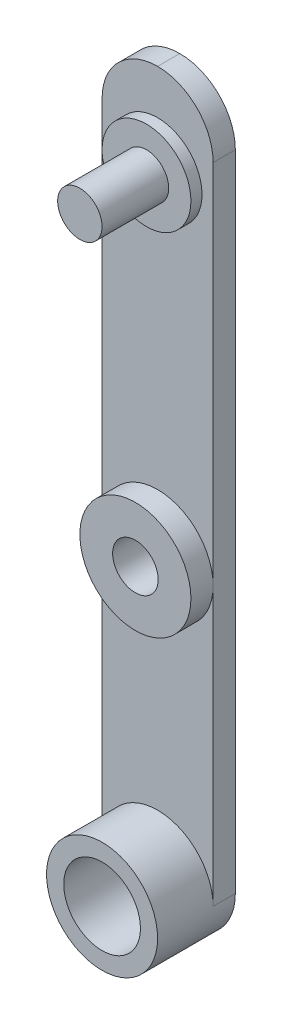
ISO-10303-21;
HEADER;
FILE_DESCRIPTION(('STEP AP214'),'2;1');
FILE_NAME('part.step','',(''),(''),'','','');
FILE_SCHEMA(('AUTOMOTIVE_DESIGN { 1 0 10303 214 1 1 1 1 }'));
ENDSEC;
DATA;
#1=APPLICATION_CONTEXT('core data for automotive mechanical design processes');
#2=APPLICATION_PROTOCOL_DEFINITION('international standard','automotive_design',2000,#1);
#3=PRODUCT_CONTEXT('',#1,'mechanical');
#4=PRODUCT('Part','Part','',(#3));
#5=PRODUCT_RELATED_PRODUCT_CATEGORY('part','',(#4));
#6=PRODUCT_DEFINITION_FORMATION('','',#4);
#7=PRODUCT_DEFINITION_CONTEXT('part definition',#1,'design');
#8=PRODUCT_DEFINITION('design','',#6,#7);
#9=PRODUCT_DEFINITION_SHAPE('','',#8);
#10=(LENGTH_UNIT() NAMED_UNIT(*) SI_UNIT(.MILLI.,.METRE.));
#11=(NAMED_UNIT(*) PLANE_ANGLE_UNIT() SI_UNIT($,.RADIAN.));
#12=(NAMED_UNIT(*) SI_UNIT($,.STERADIAN.) SOLID_ANGLE_UNIT());
#13=UNCERTAINTY_MEASURE_WITH_UNIT(LENGTH_MEASURE(1.E-05),#10,'distance_accuracy_value','');
#14=(GEOMETRIC_REPRESENTATION_CONTEXT(3) GLOBAL_UNCERTAINTY_ASSIGNED_CONTEXT((#13)) GLOBAL_UNIT_ASSIGNED_CONTEXT((#10,
#11,#12)) REPRESENTATION_CONTEXT('',''));
#15=CARTESIAN_POINT('',(0.,0.,0.));
#16=DIRECTION('',(0.,0.,1.));
#17=DIRECTION('',(1.,0.,0.));
#18=AXIS2_PLACEMENT_3D('',#15,#16,#17);
#19=CARTESIAN_POINT('',(0.,-25.,2.));
#20=DIRECTION('',(0.,0.,1.));
#21=DIRECTION('',(1.,0.,0.));
#22=AXIS2_PLACEMENT_3D('',#19,#20,#21);
#23=PLANE('',#22);
#24=DIRECTION('',(0.,-1.,0.));
#25=VECTOR('',#24,1.);
#26=CARTESIAN_POINT('',(-5.,38.,2.));
#27=LINE('',#26,#25);
#28=CARTESIAN_POINT('',(-5.,0.,2.));
#29=VERTEX_POINT('',#28);
#30=CARTESIAN_POINT('',(-4.99999999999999,-25.,2.));
#31=VERTEX_POINT('',#30);
#32=EDGE_CURVE('E119',#29,#31,#27,.T.);
#33=ORIENTED_EDGE('',*,*,#32,.T.);
#34=CARTESIAN_POINT('',(0.,-25.,2.));
#35=DIRECTION('',(0.,0.,1.));
#36=DIRECTION('',(1.,0.,0.));
#37=AXIS2_PLACEMENT_3D('',#34,#35,#36);
#38=CIRCLE('',#37,5.);
#39=CARTESIAN_POINT('',(5.00000000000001,-25.,2.));
#40=VERTEX_POINT('',#39);
#41=EDGE_CURVE('E113',#40,#31,#38,.T.);
#42=ORIENTED_EDGE('',*,*,#41,.F.);
#43=DIRECTION('',(0.,1.,0.));
#44=VECTOR('',#43,1.);
#45=CARTESIAN_POINT('',(5.,38.,2.));
#46=LINE('',#45,#44);
#47=CARTESIAN_POINT('',(5.00000000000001,0.,2.));
#48=VERTEX_POINT('',#47);
#49=EDGE_CURVE('E96',#40,#48,#46,.T.);
#50=ORIENTED_EDGE('',*,*,#49,.T.);
#51=CARTESIAN_POINT('',(0.,0.,2.));
#52=DIRECTION('',(0.,0.,1.));
#53=DIRECTION('',(1.,0.,0.));
#54=AXIS2_PLACEMENT_3D('',#51,#52,#53);
#55=CIRCLE('',#54,5.);
#56=EDGE_CURVE('E134',#29,#48,#55,.T.);
#57=ORIENTED_EDGE('',*,*,#56,.F.);
#58=EDGE_LOOP('',(#33,#42,#50,#57));
#59=FACE_BOUND('',#58,.T.);
#60=ADVANCED_FACE('F45',(#59),#23,.T.);
#61=CARTESIAN_POINT('',(0.,30.,2.));
#62=DIRECTION('',(0.,0.,1.));
#63=DIRECTION('',(1.,0.,0.));
#64=AXIS2_PLACEMENT_3D('',#61,#62,#63);
#65=CIRCLE('',#64,4.);
#66=CARTESIAN_POINT('',(4.,30.,2.));
#67=VERTEX_POINT('',#66);
#68=EDGE_CURVE('E144',#67,#67,#65,.T.);
#69=ORIENTED_EDGE('',*,*,#68,.F.);
#70=EDGE_LOOP('',(#69));
#71=FACE_BOUND('',#70,.T.);
#72=CARTESIAN_POINT('',(5.,33.,2.));
#73=VERTEX_POINT('',#72);
#74=EDGE_CURVE('E103',#48,#73,#46,.T.);
#75=ORIENTED_EDGE('',*,*,#74,.T.);
#76=CARTESIAN_POINT('',(0.,33.,2.));
#77=DIRECTION('',(0.,0.,1.));
#78=DIRECTION('',(1.,0.,0.));
#79=AXIS2_PLACEMENT_3D('',#76,#77,#78);
#80=CIRCLE('',#79,5.);
#81=CARTESIAN_POINT('',(0.,38.,2.));
#82=VERTEX_POINT('',#81);
#83=EDGE_CURVE('E54',#73,#82,#80,.T.);
#84=ORIENTED_EDGE('',*,*,#83,.T.);
#85=CARTESIAN_POINT('',(0.,33.,2.));
#86=DIRECTION('',(0.,0.,1.));
#87=DIRECTION('',(1.,0.,0.));
#88=AXIS2_PLACEMENT_3D('',#85,#86,#87);
#89=CIRCLE('',#88,5.);
#90=CARTESIAN_POINT('',(-5.,33.,2.));
#91=VERTEX_POINT('',#90);
#92=EDGE_CURVE('E64',#82,#91,#89,.T.);
#93=ORIENTED_EDGE('',*,*,#92,.T.);
#94=EDGE_CURVE('E155',#91,#29,#27,.T.);
#95=ORIENTED_EDGE('',*,*,#94,.T.);
#96=EDGE_CURVE('E139',#48,#29,#55,.T.);
#97=ORIENTED_EDGE('',*,*,#96,.F.);
#98=EDGE_LOOP('',(#75,#84,#93,#95,#97));
#99=FACE_BOUND('',#98,.T.);
#100=ADVANCED_FACE('F175',(#71,#99),#23,.T.);
#101=CARTESIAN_POINT('',(-5.,38.,2.));
#102=DIRECTION('',(1.,0.,0.));
#103=DIRECTION('',(0.,1.,0.));
#104=AXIS2_PLACEMENT_3D('',#101,#102,#103);
#105=PLANE('',#104);
#106=ORIENTED_EDGE('',*,*,#94,.F.);
#107=DIRECTION('',(0.,0.,-1.));
#108=VECTOR('',#107,1.);
#109=CARTESIAN_POINT('',(-5.,33.,2.));
#110=LINE('',#109,#108);
#111=CARTESIAN_POINT('',(-5.,33.,0.));
#112=VERTEX_POINT('',#111);
#113=EDGE_CURVE('E13',#91,#112,#110,.T.);
#114=ORIENTED_EDGE('',*,*,#113,.T.);
#115=DIRECTION('',(0.,-1.,0.));
#116=VECTOR('',#115,1.);
#117=CARTESIAN_POINT('',(-5.,38.,0.));
#118=LINE('',#117,#116);
#119=CARTESIAN_POINT('',(-4.99999999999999,-25.,0.));
#120=VERTEX_POINT('',#119);
#121=EDGE_CURVE('E157',#112,#120,#118,.T.);
#122=ORIENTED_EDGE('',*,*,#121,.T.);
#123=DIRECTION('',(0.,0.,-1.));
#124=VECTOR('',#123,1.);
#125=CARTESIAN_POINT('',(-4.99999999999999,-25.,2.));
#126=LINE('',#125,#124);
#127=EDGE_CURVE('E116',#31,#120,#126,.T.);
#128=ORIENTED_EDGE('',*,*,#127,.F.);
#129=ORIENTED_EDGE('',*,*,#32,.F.);
#130=EDGE_LOOP('',(#106,#114,#122,#128,#129));
#131=FACE_BOUND('',#130,.T.);
#132=ADVANCED_FACE('F179',(#131),#105,.F.);
#133=CARTESIAN_POINT('',(0.,-25.,2.));
#134=DIRECTION('',(0.,0.,-1.));
#135=DIRECTION('',(-1.,0.,0.));
#136=AXIS2_PLACEMENT_3D('',#133,#134,#135);
#137=CYLINDRICAL_SURFACE('',#136,5.);
#138=CARTESIAN_POINT('',(0.,-25.,0.));
#139=DIRECTION('',(0.,0.,1.));
#140=DIRECTION('',(1.,0.,0.));
#141=AXIS2_PLACEMENT_3D('',#138,#139,#140);
#142=CIRCLE('',#141,5.);
#143=CARTESIAN_POINT('',(5.00000000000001,-25.,0.));
#144=VERTEX_POINT('',#143);
#145=EDGE_CURVE('E115',#120,#144,#142,.T.);
#146=ORIENTED_EDGE('',*,*,#145,.T.);
#147=DIRECTION('',(0.,0.,-1.));
#148=VECTOR('',#147,1.);
#149=CARTESIAN_POINT('',(5.00000000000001,-25.,2.));
#150=LINE('',#149,#148);
#151=EDGE_CURVE('E100',#40,#144,#150,.T.);
#152=ORIENTED_EDGE('',*,*,#151,.F.);
#153=ORIENTED_EDGE('',*,*,#41,.T.);
#154=ORIENTED_EDGE('',*,*,#127,.T.);
#155=EDGE_LOOP('',(#146,#152,#153,#154));
#156=FACE_BOUND('',#155,.T.);
#157=CARTESIAN_POINT('',(0.,-25.,7.));
#158=DIRECTION('',(0.,0.,1.));
#159=DIRECTION('',(1.,0.,0.));
#160=AXIS2_PLACEMENT_3D('',#157,#158,#159);
#161=CIRCLE('',#160,5.);
#162=CARTESIAN_POINT('',(5.00000000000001,-25.,7.));
#163=VERTEX_POINT('',#162);
#164=EDGE_CURVE('E121',#163,#163,#161,.T.);
#165=ORIENTED_EDGE('',*,*,#164,.F.);
#166=EDGE_LOOP('',(#165));
#167=FACE_BOUND('',#166,.T.);
#168=ADVANCED_FACE('F110',(#156,#167),#137,.T.);
#169=CARTESIAN_POINT('',(5.,38.,2.));
#170=DIRECTION('',(-1.,0.,0.));
#171=DIRECTION('',(0.,-1.,0.));
#172=AXIS2_PLACEMENT_3D('',#169,#170,#171);
#173=PLANE('',#172);
#174=DIRECTION('',(0.,1.,0.));
#175=VECTOR('',#174,1.);
#176=CARTESIAN_POINT('',(5.,38.,0.));
#177=LINE('',#176,#175);
#178=CARTESIAN_POINT('',(5.,33.,0.));
#179=VERTEX_POINT('',#178);
#180=EDGE_CURVE('E160',#144,#179,#177,.T.);
#181=ORIENTED_EDGE('',*,*,#180,.T.);
#182=DIRECTION('',(0.,0.,-1.));
#183=VECTOR('',#182,1.);
#184=CARTESIAN_POINT('',(5.,33.,2.));
#185=LINE('',#184,#183);
#186=EDGE_CURVE('E168',#179,#73,#185,.F.);
#187=ORIENTED_EDGE('',*,*,#186,.T.);
#188=ORIENTED_EDGE('',*,*,#74,.F.);
#189=ORIENTED_EDGE('',*,*,#49,.F.);
#190=ORIENTED_EDGE('',*,*,#151,.T.);
#191=EDGE_LOOP('',(#181,#187,#188,#189,#190));
#192=FACE_BOUND('',#191,.T.);
#193=ADVANCED_FACE('F99',(#192),#173,.F.);
#194=CARTESIAN_POINT('',(0.,-25.,0.));
#195=DIRECTION('',(0.,0.,1.));
#196=DIRECTION('',(1.,0.,0.));
#197=AXIS2_PLACEMENT_3D('',#194,#195,#196);
#198=PLANE('',#197);
#199=CARTESIAN_POINT('',(0.,-25.,0.));
#200=DIRECTION('',(0.,0.,1.));
#201=DIRECTION('',(1.,0.,0.));
#202=AXIS2_PLACEMENT_3D('',#199,#200,#201);
#203=CIRCLE('',#202,3.45434937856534);
#204=CARTESIAN_POINT('',(3.45434937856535,-25.,0.));
#205=VERTEX_POINT('',#204);
#206=EDGE_CURVE('E122',#205,#205,#203,.T.);
#207=ORIENTED_EDGE('',*,*,#206,.T.);
#208=EDGE_LOOP('',(#207));
#209=FACE_BOUND('',#208,.T.);
#210=CARTESIAN_POINT('',(0.,0.,0.));
#211=DIRECTION('',(0.,0.,1.));
#212=DIRECTION('',(1.,0.,0.));
#213=AXIS2_PLACEMENT_3D('',#210,#211,#212);
#214=CIRCLE('',#213,2.05);
#215=CARTESIAN_POINT('',(2.05,0.,0.));
#216=VERTEX_POINT('',#215);
#217=EDGE_CURVE('E152',#216,#216,#214,.T.);
#218=ORIENTED_EDGE('',*,*,#217,.T.);
#219=EDGE_LOOP('',(#218));
#220=FACE_BOUND('',#219,.T.);
#221=CARTESIAN_POINT('',(0.,33.,0.));
#222=DIRECTION('',(0.,0.,1.));
#223=DIRECTION('',(1.,0.,0.));
#224=AXIS2_PLACEMENT_3D('',#221,#222,#223);
#225=CIRCLE('',#224,5.);
#226=CARTESIAN_POINT('',(0.,38.,0.));
#227=VERTEX_POINT('',#226);
#228=EDGE_CURVE('E148',#112,#227,#225,.F.);
#229=ORIENTED_EDGE('',*,*,#228,.T.);
#230=CARTESIAN_POINT('',(0.,33.,0.));
#231=DIRECTION('',(0.,0.,1.));
#232=DIRECTION('',(1.,0.,0.));
#233=AXIS2_PLACEMENT_3D('',#230,#231,#232);
#234=CIRCLE('',#233,5.);
#235=EDGE_CURVE('E166',#227,#179,#234,.F.);
#236=ORIENTED_EDGE('',*,*,#235,.T.);
#237=ORIENTED_EDGE('',*,*,#180,.F.);
#238=ORIENTED_EDGE('',*,*,#145,.F.);
#239=ORIENTED_EDGE('',*,*,#121,.F.);
#240=EDGE_LOOP('',(#229,#236,#237,#238,#239));
#241=FACE_BOUND('',#240,.T.);
#242=ADVANCED_FACE('F184',(#209,#220,#241),#198,.F.);
#243=CARTESIAN_POINT('',(0.,0.,-8.));
#244=DIRECTION('',(0.,0.,1.));
#245=DIRECTION('',(1.,0.,0.));
#246=AXIS2_PLACEMENT_3D('',#243,#244,#245);
#247=CYLINDRICAL_SURFACE('',#246,2.05);
#248=ORIENTED_EDGE('',*,*,#217,.F.);
#249=EDGE_LOOP('',(#248));
#250=FACE_BOUND('',#249,.T.);
#251=CARTESIAN_POINT('',(0.,0.,4.));
#252=DIRECTION('',(0.,0.,1.));
#253=DIRECTION('',(1.,0.,0.));
#254=AXIS2_PLACEMENT_3D('',#251,#252,#253);
#255=CIRCLE('',#254,2.05);
#256=CARTESIAN_POINT('',(2.05,0.,4.));
#257=VERTEX_POINT('',#256);
#258=EDGE_CURVE('E131',#257,#257,#255,.T.);
#259=ORIENTED_EDGE('',*,*,#258,.T.);
#260=EDGE_LOOP('',(#259));
#261=FACE_BOUND('',#260,.T.);
#262=ADVANCED_FACE('F208',(#250,#261),#247,.F.);
#263=CARTESIAN_POINT('',(0.,30.,3.));
#264=DIRECTION('',(0.,0.,-1.));
#265=DIRECTION('',(-1.,0.,0.));
#266=AXIS2_PLACEMENT_3D('',#263,#264,#265);
#267=CYLINDRICAL_SURFACE('',#266,4.);
#268=CARTESIAN_POINT('',(0.,30.,3.));
#269=DIRECTION('',(0.,0.,1.));
#270=DIRECTION('',(1.,0.,0.));
#271=AXIS2_PLACEMENT_3D('',#268,#269,#270);
#272=CIRCLE('',#271,4.);
#273=CARTESIAN_POINT('',(4.,30.,3.));
#274=VERTEX_POINT('',#273);
#275=EDGE_CURVE('E149',#274,#274,#272,.T.);
#276=ORIENTED_EDGE('',*,*,#275,.F.);
#277=EDGE_LOOP('',(#276));
#278=FACE_BOUND('',#277,.T.);
#279=ORIENTED_EDGE('',*,*,#68,.T.);
#280=EDGE_LOOP('',(#279));
#281=FACE_BOUND('',#280,.T.);
#282=ADVANCED_FACE('F269',(#278,#281),#267,.T.);
#283=CARTESIAN_POINT('',(0.,30.,3.));
#284=DIRECTION('',(0.,0.,1.));
#285=DIRECTION('',(1.,0.,0.));
#286=AXIS2_PLACEMENT_3D('',#283,#284,#285);
#287=PLANE('',#286);
#288=CARTESIAN_POINT('',(0.,30.,3.));
#289=DIRECTION('',(0.,0.,1.));
#290=DIRECTION('',(1.,0.,0.));
#291=AXIS2_PLACEMENT_3D('',#288,#289,#290);
#292=CIRCLE('',#291,2.);
#293=CARTESIAN_POINT('',(2.,30.,3.));
#294=VERTEX_POINT('',#293);
#295=EDGE_CURVE('E145',#294,#294,#292,.T.);
#296=ORIENTED_EDGE('',*,*,#295,.F.);
#297=EDGE_LOOP('',(#296));
#298=FACE_BOUND('',#297,.T.);
#299=ORIENTED_EDGE('',*,*,#275,.T.);
#300=EDGE_LOOP('',(#299));
#301=FACE_BOUND('',#300,.T.);
#302=ADVANCED_FACE('F266',(#298,#301),#287,.T.);
#303=CARTESIAN_POINT('',(0.,30.,9.));
#304=DIRECTION('',(0.,0.,-1.));
#305=DIRECTION('',(-1.,0.,0.));
#306=AXIS2_PLACEMENT_3D('',#303,#304,#305);
#307=CYLINDRICAL_SURFACE('',#306,2.);
#308=CARTESIAN_POINT('',(0.,30.,9.));
#309=DIRECTION('',(0.,0.,1.));
#310=DIRECTION('',(1.,0.,0.));
#311=AXIS2_PLACEMENT_3D('',#308,#309,#310);
#312=CIRCLE('',#311,2.);
#313=CARTESIAN_POINT('',(2.,30.,9.));
#314=VERTEX_POINT('',#313);
#315=EDGE_CURVE('E138',#314,#314,#312,.T.);
#316=ORIENTED_EDGE('',*,*,#315,.F.);
#317=EDGE_LOOP('',(#316));
#318=FACE_BOUND('',#317,.T.);
#319=ORIENTED_EDGE('',*,*,#295,.T.);
#320=EDGE_LOOP('',(#319));
#321=FACE_BOUND('',#320,.T.);
#322=ADVANCED_FACE('F262',(#318,#321),#307,.T.);
#323=CARTESIAN_POINT('',(0.,30.,9.));
#324=DIRECTION('',(0.,0.,1.));
#325=DIRECTION('',(1.,0.,0.));
#326=AXIS2_PLACEMENT_3D('',#323,#324,#325);
#327=PLANE('',#326);
#328=ORIENTED_EDGE('',*,*,#315,.T.);
#329=EDGE_LOOP('',(#328));
#330=FACE_BOUND('',#329,.T.);
#331=ADVANCED_FACE('F257',(#330),#327,.T.);
#332=CARTESIAN_POINT('',(0.,0.,4.));
#333=DIRECTION('',(0.,0.,1.));
#334=DIRECTION('',(1.,0.,0.));
#335=AXIS2_PLACEMENT_3D('',#332,#333,#334);
#336=PLANE('',#335);
#337=CARTESIAN_POINT('',(0.,0.,4.));
#338=DIRECTION('',(0.,0.,1.));
#339=DIRECTION('',(1.,0.,0.));
#340=AXIS2_PLACEMENT_3D('',#337,#338,#339);
#341=CIRCLE('',#340,5.);
#342=CARTESIAN_POINT('',(5.,0.,4.));
#343=VERTEX_POINT('',#342);
#344=EDGE_CURVE('E135',#343,#343,#341,.T.);
#345=ORIENTED_EDGE('',*,*,#344,.T.);
#346=EDGE_LOOP('',(#345));
#347=FACE_BOUND('',#346,.T.);
#348=ORIENTED_EDGE('',*,*,#258,.F.);
#349=EDGE_LOOP('',(#348));
#350=FACE_BOUND('',#349,.T.);
#351=ADVANCED_FACE('F195',(#347,#350),#336,.T.);
#352=CARTESIAN_POINT('',(0.,0.,4.));
#353=DIRECTION('',(0.,0.,-1.));
#354=DIRECTION('',(-1.,0.,0.));
#355=AXIS2_PLACEMENT_3D('',#352,#353,#354);
#356=CYLINDRICAL_SURFACE('',#355,5.);
#357=ORIENTED_EDGE('',*,*,#344,.F.);
#358=EDGE_LOOP('',(#357));
#359=FACE_BOUND('',#358,.T.);
#360=ORIENTED_EDGE('',*,*,#96,.T.);
#361=ORIENTED_EDGE('',*,*,#56,.T.);
#362=EDGE_LOOP('',(#360,#361));
#363=FACE_BOUND('',#362,.T.);
#364=ADVANCED_FACE('F177',(#359,#363),#356,.T.);
#365=CARTESIAN_POINT('',(0.,33.,2.));
#366=DIRECTION('',(0.,0.,-1.));
#367=DIRECTION('',(-1.,0.,0.));
#368=AXIS2_PLACEMENT_3D('',#365,#366,#367);
#369=CYLINDRICAL_SURFACE('',#368,5.);
#370=ORIENTED_EDGE('',*,*,#113,.F.);
#371=ORIENTED_EDGE('',*,*,#92,.F.);
#372=DIRECTION('',(0.,0.,-1.));
#373=VECTOR('',#372,1.);
#374=CARTESIAN_POINT('',(0.,38.,2.));
#375=LINE('',#374,#373);
#376=EDGE_CURVE('E49',#227,#82,#375,.F.);
#377=ORIENTED_EDGE('',*,*,#376,.F.);
#378=ORIENTED_EDGE('',*,*,#228,.F.);
#379=EDGE_LOOP('',(#370,#371,#377,#378));
#380=FACE_BOUND('',#379,.T.);
#381=ADVANCED_FACE('F47',(#380),#369,.T.);
#382=CARTESIAN_POINT('',(0.,33.,2.));
#383=DIRECTION('',(0.,0.,-1.));
#384=DIRECTION('',(-1.,0.,0.));
#385=AXIS2_PLACEMENT_3D('',#382,#383,#384);
#386=CYLINDRICAL_SURFACE('',#385,5.);
#387=ORIENTED_EDGE('',*,*,#83,.F.);
#388=ORIENTED_EDGE('',*,*,#186,.F.);
#389=ORIENTED_EDGE('',*,*,#235,.F.);
#390=ORIENTED_EDGE('',*,*,#376,.T.);
#391=EDGE_LOOP('',(#387,#388,#389,#390));
#392=FACE_BOUND('',#391,.T.);
#393=ADVANCED_FACE('F187',(#392),#386,.T.);
#394=CARTESIAN_POINT('',(0.,-25.,7.));
#395=DIRECTION('',(0.,0.,1.));
#396=DIRECTION('',(1.,0.,0.));
#397=AXIS2_PLACEMENT_3D('',#394,#395,#396);
#398=PLANE('',#397);
#399=CARTESIAN_POINT('',(0.,-25.,7.));
#400=DIRECTION('',(0.,0.,1.));
#401=DIRECTION('',(1.,0.,0.));
#402=AXIS2_PLACEMENT_3D('',#399,#400,#401);
#403=CIRCLE('',#402,3.45434937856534);
#404=CARTESIAN_POINT('',(3.45434937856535,-25.,7.));
#405=VERTEX_POINT('',#404);
#406=EDGE_CURVE('E127',#405,#405,#403,.T.);
#407=ORIENTED_EDGE('',*,*,#406,.F.);
#408=EDGE_LOOP('',(#407));
#409=FACE_BOUND('',#408,.T.);
#410=ORIENTED_EDGE('',*,*,#164,.T.);
#411=EDGE_LOOP('',(#410));
#412=FACE_BOUND('',#411,.T.);
#413=ADVANCED_FACE('F194',(#409,#412),#398,.T.);
#414=CARTESIAN_POINT('',(0.,-25.,0.));
#415=DIRECTION('',(0.,0.,1.));
#416=DIRECTION('',(1.,0.,0.));
#417=AXIS2_PLACEMENT_3D('',#414,#415,#416);
#418=CYLINDRICAL_SURFACE('',#417,3.45434937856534);
#419=ORIENTED_EDGE('',*,*,#206,.F.);
#420=EDGE_LOOP('',(#419));
#421=FACE_BOUND('',#420,.T.);
#422=ORIENTED_EDGE('',*,*,#406,.T.);
#423=EDGE_LOOP('',(#422));
#424=FACE_BOUND('',#423,.T.);
#425=ADVANCED_FACE('F239',(#421,#424),#418,.F.);
#426=CLOSED_SHELL('',(#60,#100,#132,#168,#193,#242,#262,#282,#302,#322,#331,#351,#364,#381,#393,
#413,#425));
#427=MANIFOLD_SOLID_BREP('B2',#426);
#428=ADVANCED_BREP_SHAPE_REPRESENTATION('',(#18,#427),#14);
#429=SHAPE_DEFINITION_REPRESENTATION(#9,#428);
ENDSEC;
END-ISO-10303-21;
